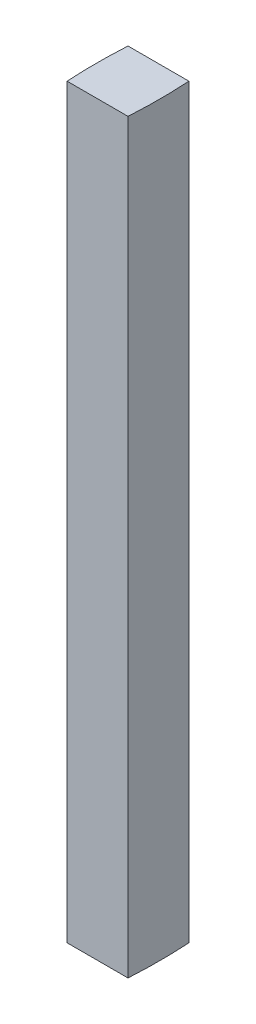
ISO-10303-21;
HEADER;
FILE_DESCRIPTION(('STEP AP214'),'2;1');
FILE_NAME('part.step','',(''),(''),'','','');
FILE_SCHEMA(('AUTOMOTIVE_DESIGN { 1 0 10303 214 1 1 1 1 }'));
ENDSEC;
DATA;
#1=APPLICATION_CONTEXT('core data for automotive mechanical design processes');
#2=APPLICATION_PROTOCOL_DEFINITION('international standard','automotive_design',2000,#1);
#3=PRODUCT_CONTEXT('',#1,'mechanical');
#4=PRODUCT('Part','Part','',(#3));
#5=PRODUCT_RELATED_PRODUCT_CATEGORY('part','',(#4));
#6=PRODUCT_DEFINITION_FORMATION('','',#4);
#7=PRODUCT_DEFINITION_CONTEXT('part definition',#1,'design');
#8=PRODUCT_DEFINITION('design','',#6,#7);
#9=PRODUCT_DEFINITION_SHAPE('','',#8);
#10=(LENGTH_UNIT() NAMED_UNIT(*) SI_UNIT(.MILLI.,.METRE.));
#11=(NAMED_UNIT(*) PLANE_ANGLE_UNIT() SI_UNIT($,.RADIAN.));
#12=(NAMED_UNIT(*) SI_UNIT($,.STERADIAN.) SOLID_ANGLE_UNIT());
#13=UNCERTAINTY_MEASURE_WITH_UNIT(LENGTH_MEASURE(1.E-05),#10,'distance_accuracy_value','');
#14=(GEOMETRIC_REPRESENTATION_CONTEXT(3) GLOBAL_UNCERTAINTY_ASSIGNED_CONTEXT((#13)) GLOBAL_UNIT_ASSIGNED_CONTEXT((#10,
#11,#12)) REPRESENTATION_CONTEXT('',''));
#15=CARTESIAN_POINT('',(0.,0.,0.));
#16=DIRECTION('',(0.,0.,1.));
#17=DIRECTION('',(1.,0.,0.));
#18=AXIS2_PLACEMENT_3D('',#15,#16,#17);
#19=CARTESIAN_POINT('',(230.,367.5,0.));
#20=DIRECTION('',(0.,-1.,0.));
#21=DIRECTION('',(0.,0.,-1.));
#22=AXIS2_PLACEMENT_3D('',#19,#20,#21);
#23=CYLINDRICAL_SURFACE('',#22,250.);
#24=CARTESIAN_POINT('',(230.,0.,0.));
#25=DIRECTION('',(0.,1.,0.));
#26=DIRECTION('',(0.,0.,1.));
#27=AXIS2_PLACEMENT_3D('',#24,#25,#26);
#28=CIRCLE('',#27,250.);
#29=CARTESIAN_POINT('',(-19.5495942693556,0.,-15.));
#30=VERTEX_POINT('',#29);
#31=CARTESIAN_POINT('',(-19.5495942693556,0.,15.));
#32=VERTEX_POINT('',#31);
#33=EDGE_CURVE('E96',#30,#32,#28,.T.);
#34=ORIENTED_EDGE('',*,*,#33,.T.);
#35=DIRECTION('',(0.,-1.,0.));
#36=VECTOR('',#35,1.);
#37=CARTESIAN_POINT('',(-19.5495942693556,367.5,15.));
#38=LINE('',#37,#36);
#39=CARTESIAN_POINT('',(-19.5495942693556,367.5,15.));
#40=VERTEX_POINT('',#39);
#41=EDGE_CURVE('E11',#40,#32,#38,.T.);
#42=ORIENTED_EDGE('',*,*,#41,.F.);
#43=CARTESIAN_POINT('',(230.,367.5,0.));
#44=DIRECTION('',(0.,1.,0.));
#45=DIRECTION('',(0.,0.,1.));
#46=AXIS2_PLACEMENT_3D('',#43,#44,#45);
#47=CIRCLE('',#46,250.);
#48=CARTESIAN_POINT('',(-19.5495942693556,367.5,-15.));
#49=VERTEX_POINT('',#48);
#50=EDGE_CURVE('E84',#49,#40,#47,.T.);
#51=ORIENTED_EDGE('',*,*,#50,.F.);
#52=DIRECTION('',(0.,-1.,0.));
#53=VECTOR('',#52,1.);
#54=CARTESIAN_POINT('',(-19.5495942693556,367.5,-15.));
#55=LINE('',#54,#53);
#56=EDGE_CURVE('E92',#49,#30,#55,.T.);
#57=ORIENTED_EDGE('',*,*,#56,.T.);
#58=EDGE_LOOP('',(#34,#42,#51,#57));
#59=FACE_BOUND('',#58,.T.);
#60=ADVANCED_FACE('F33',(#59),#23,.T.);
#61=CARTESIAN_POINT('',(-19.5495942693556,367.5,15.));
#62=DIRECTION('',(0.,0.,-1.));
#63=DIRECTION('',(-1.,0.,0.));
#64=AXIS2_PLACEMENT_3D('',#61,#62,#63);
#65=PLANE('',#64);
#66=DIRECTION('',(1.,0.,0.));
#67=VECTOR('',#66,1.);
#68=CARTESIAN_POINT('',(-19.5495942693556,0.,15.));
#69=LINE('',#68,#67);
#70=CARTESIAN_POINT('',(10.4504057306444,0.,15.));
#71=VERTEX_POINT('',#70);
#72=EDGE_CURVE('E88',#32,#71,#69,.T.);
#73=ORIENTED_EDGE('',*,*,#72,.T.);
#74=DIRECTION('',(0.,-1.,0.));
#75=VECTOR('',#74,1.);
#76=CARTESIAN_POINT('',(10.4504057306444,367.5,15.));
#77=LINE('',#76,#75);
#78=CARTESIAN_POINT('',(10.4504057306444,367.5,15.));
#79=VERTEX_POINT('',#78);
#80=EDGE_CURVE('E41',#79,#71,#77,.T.);
#81=ORIENTED_EDGE('',*,*,#80,.F.);
#82=DIRECTION('',(1.,0.,0.));
#83=VECTOR('',#82,1.);
#84=CARTESIAN_POINT('',(-19.5495942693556,367.5,15.));
#85=LINE('',#84,#83);
#86=EDGE_CURVE('E79',#40,#79,#85,.T.);
#87=ORIENTED_EDGE('',*,*,#86,.F.);
#88=ORIENTED_EDGE('',*,*,#41,.T.);
#89=EDGE_LOOP('',(#73,#81,#87,#88));
#90=FACE_BOUND('',#89,.T.);
#91=ADVANCED_FACE('F87',(#90),#65,.F.);
#92=CARTESIAN_POINT('',(-230.,367.5,0.));
#93=DIRECTION('',(0.,-1.,0.));
#94=DIRECTION('',(0.,0.,-1.));
#95=AXIS2_PLACEMENT_3D('',#92,#93,#94);
#96=CYLINDRICAL_SURFACE('',#95,240.917823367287);
#97=CARTESIAN_POINT('',(-230.,0.,0.));
#98=DIRECTION('',(0.,1.,0.));
#99=DIRECTION('',(0.,0.,1.));
#100=AXIS2_PLACEMENT_3D('',#97,#98,#99);
#101=CIRCLE('',#100,240.917823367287);
#102=CARTESIAN_POINT('',(10.4504057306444,0.,-15.));
#103=VERTEX_POINT('',#102);
#104=EDGE_CURVE('E66',#71,#103,#101,.T.);
#105=ORIENTED_EDGE('',*,*,#104,.T.);
#106=DIRECTION('',(0.,-1.,0.));
#107=VECTOR('',#106,1.);
#108=CARTESIAN_POINT('',(10.4504057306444,367.5,-15.));
#109=LINE('',#108,#107);
#110=CARTESIAN_POINT('',(10.4504057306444,367.5,-15.));
#111=VERTEX_POINT('',#110);
#112=EDGE_CURVE('E89',#111,#103,#109,.T.);
#113=ORIENTED_EDGE('',*,*,#112,.F.);
#114=CARTESIAN_POINT('',(-230.,367.5,0.));
#115=DIRECTION('',(0.,1.,0.));
#116=DIRECTION('',(0.,0.,1.));
#117=AXIS2_PLACEMENT_3D('',#114,#115,#116);
#118=CIRCLE('',#117,240.917823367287);
#119=EDGE_CURVE('E82',#79,#111,#118,.T.);
#120=ORIENTED_EDGE('',*,*,#119,.F.);
#121=ORIENTED_EDGE('',*,*,#80,.T.);
#122=EDGE_LOOP('',(#105,#113,#120,#121));
#123=FACE_BOUND('',#122,.T.);
#124=ADVANCED_FACE('F90',(#123),#96,.T.);
#125=CARTESIAN_POINT('',(-19.5495942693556,367.5,-15.));
#126=DIRECTION('',(0.,0.,1.));
#127=DIRECTION('',(1.,0.,0.));
#128=AXIS2_PLACEMENT_3D('',#125,#126,#127);
#129=PLANE('',#128);
#130=DIRECTION('',(-1.,0.,0.));
#131=VECTOR('',#130,1.);
#132=CARTESIAN_POINT('',(-19.5495942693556,0.,-15.));
#133=LINE('',#132,#131);
#134=EDGE_CURVE('E72',#103,#30,#133,.T.);
#135=ORIENTED_EDGE('',*,*,#134,.T.);
#136=ORIENTED_EDGE('',*,*,#56,.F.);
#137=DIRECTION('',(-1.,0.,0.));
#138=VECTOR('',#137,1.);
#139=CARTESIAN_POINT('',(-19.5495942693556,367.5,-15.));
#140=LINE('',#139,#138);
#141=EDGE_CURVE('E49',#111,#49,#140,.T.);
#142=ORIENTED_EDGE('',*,*,#141,.F.);
#143=ORIENTED_EDGE('',*,*,#112,.T.);
#144=EDGE_LOOP('',(#135,#136,#142,#143));
#145=FACE_BOUND('',#144,.T.);
#146=ADVANCED_FACE('F103',(#145),#129,.F.);
#147=CARTESIAN_POINT('',(230.,367.5,0.));
#148=DIRECTION('',(0.,1.,0.));
#149=DIRECTION('',(0.,0.,1.));
#150=AXIS2_PLACEMENT_3D('',#147,#148,#149);
#151=PLANE('',#150);
#152=ORIENTED_EDGE('',*,*,#50,.T.);
#153=ORIENTED_EDGE('',*,*,#86,.T.);
#154=ORIENTED_EDGE('',*,*,#119,.T.);
#155=ORIENTED_EDGE('',*,*,#141,.T.);
#156=EDGE_LOOP('',(#152,#153,#154,#155));
#157=FACE_BOUND('',#156,.T.);
#158=ADVANCED_FACE('F80',(#157),#151,.T.);
#159=CARTESIAN_POINT('',(230.,0.,0.));
#160=DIRECTION('',(0.,1.,0.));
#161=DIRECTION('',(0.,0.,1.));
#162=AXIS2_PLACEMENT_3D('',#159,#160,#161);
#163=PLANE('',#162);
#164=ORIENTED_EDGE('',*,*,#33,.F.);
#165=ORIENTED_EDGE('',*,*,#134,.F.);
#166=ORIENTED_EDGE('',*,*,#104,.F.);
#167=ORIENTED_EDGE('',*,*,#72,.F.);
#168=EDGE_LOOP('',(#164,#165,#166,#167));
#169=FACE_BOUND('',#168,.T.);
#170=ADVANCED_FACE('F106',(#169),#163,.F.);
#171=CLOSED_SHELL('',(#60,#91,#124,#146,#158,#170));
#172=MANIFOLD_SOLID_BREP('B2',#171);
#173=ADVANCED_BREP_SHAPE_REPRESENTATION('',(#18,#172),#14);
#174=SHAPE_DEFINITION_REPRESENTATION(#9,#173);
ENDSEC;
END-ISO-10303-21;
